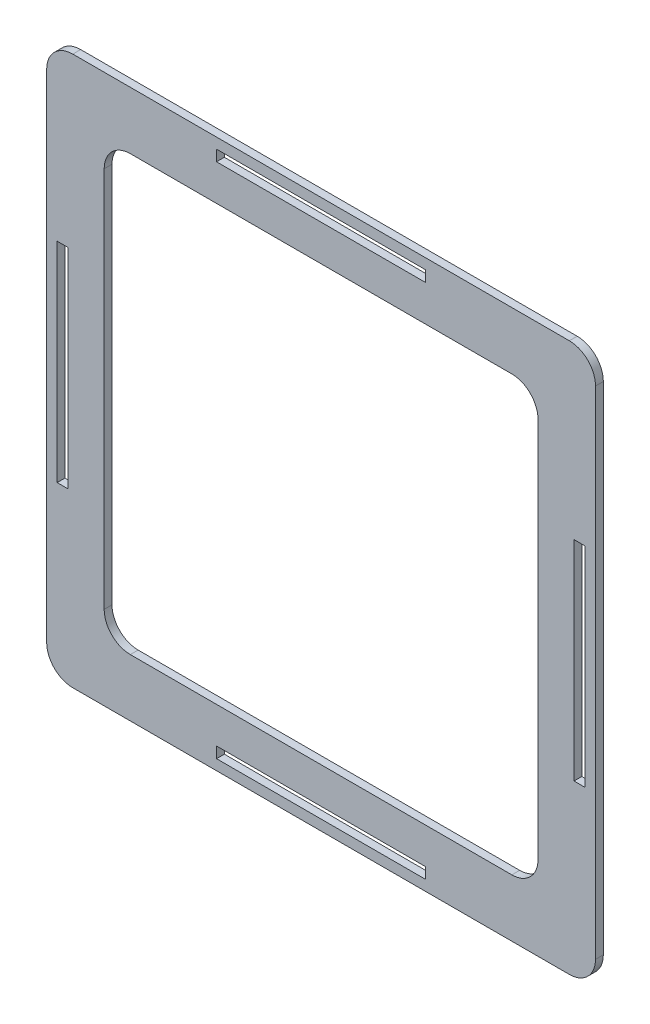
from build123d import *

# Parameters (mm, degrees)
ESQUISSE1_W        = 2.1
ESQUISSE1_H        = 40
ESQUISSE1_W_2      = 40
ESQUISSE1_H_2      = 2.1
BOSS_EXTRU_1_DEPTH = 1.5


with BuildPart() as part:
    # Esquisse1 → Boss.-Extru.1 (new body)
    with BuildSketch(Plane.XY):
        with BuildLine():
            Line((-47.5, 52.5), (47.5, 52.5))
            ThreePointArc((47.5, 52.5), (51.035533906, 51.035533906), (52.5, 47.5))
            Line((52.5, 47.5), (52.5, -47.5))
            ThreePointArc((52.5, -47.5), (51.035533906, -51.035533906), (47.5, -52.5))
            Line((47.5, -52.5), (-47.5, -52.5))
            ThreePointArc((-47.5, -52.5), (-51.035533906, -51.035533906), (-52.5, -47.5))
            Line((-52.5, -47.5), (-52.5, 47.5))
            ThreePointArc((-52.5, 47.5), (-51.035533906, 51.035533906), (-47.5, 52.5))
        make_face()
        with Locations((-49.45, 0)):
            Rectangle(ESQUISSE1_W, ESQUISSE1_H, mode=Mode.SUBTRACT)
        with Locations((0, 49.45)):
            Rectangle(ESQUISSE1_W_2, ESQUISSE1_H_2, mode=Mode.SUBTRACT)
        with Locations((49.45, 0)):
            Rectangle(ESQUISSE1_W, ESQUISSE1_H, mode=Mode.SUBTRACT)
        with Locations((0, -49.45)):
            Rectangle(ESQUISSE1_W_2, ESQUISSE1_H_2, mode=Mode.SUBTRACT)
        with BuildLine():
            Line((-36.5, 41.5), (36.5, 41.5))
            ThreePointArc((36.5, 41.5), (40.035533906, 40.035533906), (41.5, 36.5))
            Line((41.5, 36.5), (41.5, -36.5))
            ThreePointArc((41.5, -36.5), (40.035533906, -40.035533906), (36.5, -41.5))
            Line((36.5, -41.5), (-36.5, -41.5))
            ThreePointArc((-36.5, -41.5), (-40.035533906, -40.035533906), (-41.5, -36.5))
            Line((-41.5, -36.5), (-41.5, 36.5))
            ThreePointArc((-41.5, 36.5), (-40.035533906, 40.035533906), (-36.5, 41.5))
        make_face(mode=Mode.SUBTRACT)
    extrude(amount=BOSS_EXTRU_1_DEPTH)


solid = part.part
